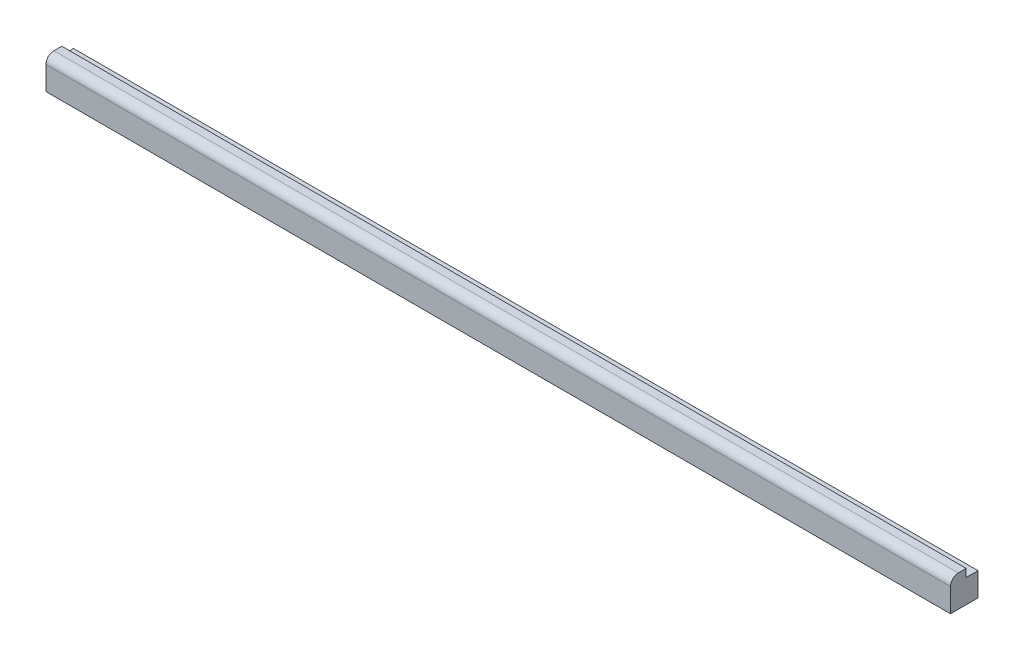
from build123d import *

# Parameters (mm, degrees)
SKETCH1_W           = 22.225
SKETCH1_H           = 25.4
BOSS_EXTRUDE1_DEPTH = 365.125
FILLET1_R           = 6.35
SKETCH2_W           = 9.525
SKETCH2_H           = 6.35
CUT_EXTRUDE1_DEPTH  = 731.444960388


with BuildPart() as part:
    # Sketch1 → Boss-Extrude1 (new, symmetric)
    with BuildSketch(Plane(origin=(0, 0, 0), x_dir=(0, 0, -1), z_dir=(1, 0, 0))):
        Rectangle(SKETCH1_W, SKETCH1_H)
    extrude(amount=BOSS_EXTRUDE1_DEPTH, both=True)

    # Fillet1
    fillet1_edges = [part.edges().sort_by_distance(p)[0] for p in [
        (0, 12.7, 11.1125),
    ]]
    fillet(fillet1_edges, radius=FILLET1_R)

    # Sketch2 → Cut-Extrude1 (cut, through all)
    with BuildSketch(Plane(origin=(365.125, 0, 0), x_dir=(0, 0, -1), z_dir=(1, 0, 0))):
        with Locations((6.35, 9.525)):
            Rectangle(SKETCH2_W, SKETCH2_H)
    extrude(amount=-CUT_EXTRUDE1_DEPTH, mode=Mode.SUBTRACT)


solid = part.part
